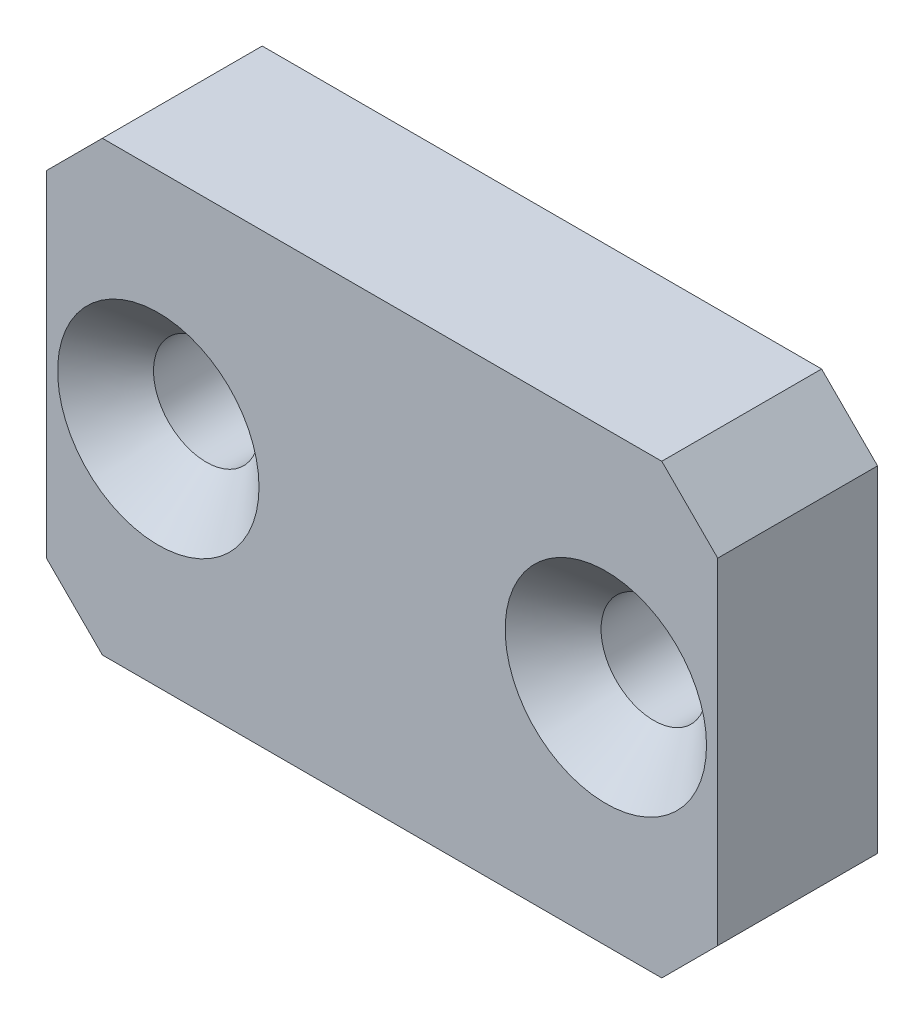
ISO-10303-21;
HEADER;
FILE_DESCRIPTION(('STEP AP214'),'2;1');
FILE_NAME('part.step','',(''),(''),'','','');
FILE_SCHEMA(('AUTOMOTIVE_DESIGN { 1 0 10303 214 1 1 1 1 }'));
ENDSEC;
DATA;
#1=APPLICATION_CONTEXT('core data for automotive mechanical design processes');
#2=APPLICATION_PROTOCOL_DEFINITION('international standard','automotive_design',2000,#1);
#3=PRODUCT_CONTEXT('',#1,'mechanical');
#4=PRODUCT('Part','Part','',(#3));
#5=PRODUCT_RELATED_PRODUCT_CATEGORY('part','',(#4));
#6=PRODUCT_DEFINITION_FORMATION('','',#4);
#7=PRODUCT_DEFINITION_CONTEXT('part definition',#1,'design');
#8=PRODUCT_DEFINITION('design','',#6,#7);
#9=PRODUCT_DEFINITION_SHAPE('','',#8);
#10=(LENGTH_UNIT() NAMED_UNIT(*) SI_UNIT(.MILLI.,.METRE.));
#11=(NAMED_UNIT(*) PLANE_ANGLE_UNIT() SI_UNIT($,.RADIAN.));
#12=(NAMED_UNIT(*) SI_UNIT($,.STERADIAN.) SOLID_ANGLE_UNIT());
#13=UNCERTAINTY_MEASURE_WITH_UNIT(LENGTH_MEASURE(1.E-05),#10,'distance_accuracy_value','');
#14=(GEOMETRIC_REPRESENTATION_CONTEXT(3) GLOBAL_UNCERTAINTY_ASSIGNED_CONTEXT((#13)) GLOBAL_UNIT_ASSIGNED_CONTEXT((#10,
#11,#12)) REPRESENTATION_CONTEXT('',''));
#15=CARTESIAN_POINT('',(0.,0.,0.));
#16=DIRECTION('',(0.,0.,1.));
#17=DIRECTION('',(1.,0.,0.));
#18=AXIS2_PLACEMENT_3D('',#15,#16,#17);
#19=CARTESIAN_POINT('',(-21.,14.,10.));
#20=DIRECTION('',(1.,0.,0.));
#21=DIRECTION('',(0.,0.,-1.));
#22=AXIS2_PLACEMENT_3D('',#19,#20,#21);
#23=PLANE('',#22);
#24=DIRECTION('',(0.,-1.,0.));
#25=VECTOR('',#24,1.);
#26=CARTESIAN_POINT('',(-21.,14.,0.));
#27=LINE('',#26,#25);
#28=CARTESIAN_POINT('',(-21.,10.5,0.));
#29=VERTEX_POINT('',#28);
#30=CARTESIAN_POINT('',(-21.,-10.5,0.));
#31=VERTEX_POINT('',#30);
#32=EDGE_CURVE('E159',#29,#31,#27,.T.);
#33=ORIENTED_EDGE('',*,*,#32,.T.);
#34=DIRECTION('',(0.,0.,1.));
#35=VECTOR('',#34,1.);
#36=CARTESIAN_POINT('',(-21.,-10.5,10.));
#37=LINE('',#36,#35);
#38=CARTESIAN_POINT('',(-21.,-10.5,10.));
#39=VERTEX_POINT('',#38);
#40=EDGE_CURVE('E11',#31,#39,#37,.T.);
#41=ORIENTED_EDGE('',*,*,#40,.T.);
#42=DIRECTION('',(0.,-1.,0.));
#43=VECTOR('',#42,1.);
#44=CARTESIAN_POINT('',(-21.,14.,10.));
#45=LINE('',#44,#43);
#46=CARTESIAN_POINT('',(-21.,10.5,10.));
#47=VERTEX_POINT('',#46);
#48=EDGE_CURVE('E127',#47,#39,#45,.T.);
#49=ORIENTED_EDGE('',*,*,#48,.F.);
#50=DIRECTION('',(0.,0.,-1.));
#51=VECTOR('',#50,1.);
#52=CARTESIAN_POINT('',(-21.,10.5,10.));
#53=LINE('',#52,#51);
#54=EDGE_CURVE('E43',#47,#29,#53,.T.);
#55=ORIENTED_EDGE('',*,*,#54,.T.);
#56=EDGE_LOOP('',(#33,#41,#49,#55));
#57=FACE_BOUND('',#56,.T.);
#58=ADVANCED_FACE('F35',(#57),#23,.F.);
#59=CARTESIAN_POINT('',(-21.,-14.,10.));
#60=DIRECTION('',(0.,1.,0.));
#61=DIRECTION('',(-1.,0.,0.));
#62=AXIS2_PLACEMENT_3D('',#59,#60,#61);
#63=PLANE('',#62);
#64=DIRECTION('',(1.,0.,0.));
#65=VECTOR('',#64,1.);
#66=CARTESIAN_POINT('',(-21.,-14.,0.));
#67=LINE('',#66,#65);
#68=CARTESIAN_POINT('',(-17.5,-14.,0.));
#69=VERTEX_POINT('',#68);
#70=CARTESIAN_POINT('',(17.5,-14.,0.));
#71=VERTEX_POINT('',#70);
#72=EDGE_CURVE('E132',#69,#71,#67,.T.);
#73=ORIENTED_EDGE('',*,*,#72,.T.);
#74=DIRECTION('',(0.,0.,1.));
#75=VECTOR('',#74,1.);
#76=CARTESIAN_POINT('',(17.5,-14.,10.));
#77=LINE('',#76,#75);
#78=CARTESIAN_POINT('',(17.5,-14.,10.));
#79=VERTEX_POINT('',#78);
#80=EDGE_CURVE('E50',#71,#79,#77,.T.);
#81=ORIENTED_EDGE('',*,*,#80,.T.);
#82=DIRECTION('',(1.,0.,0.));
#83=VECTOR('',#82,1.);
#84=CARTESIAN_POINT('',(-21.,-14.,10.));
#85=LINE('',#84,#83);
#86=CARTESIAN_POINT('',(-17.5,-14.,10.));
#87=VERTEX_POINT('',#86);
#88=EDGE_CURVE('E130',#87,#79,#85,.T.);
#89=ORIENTED_EDGE('',*,*,#88,.F.);
#90=DIRECTION('',(0.,0.,-1.));
#91=VECTOR('',#90,1.);
#92=CARTESIAN_POINT('',(-17.5,-14.,10.));
#93=LINE('',#92,#91);
#94=EDGE_CURVE('E151',#87,#69,#93,.T.);
#95=ORIENTED_EDGE('',*,*,#94,.T.);
#96=EDGE_LOOP('',(#73,#81,#89,#95));
#97=FACE_BOUND('',#96,.T.);
#98=ADVANCED_FACE('F217',(#97),#63,.F.);
#99=CARTESIAN_POINT('',(21.,14.,10.));
#100=DIRECTION('',(-1.,0.,0.));
#101=DIRECTION('',(0.,0.,1.));
#102=AXIS2_PLACEMENT_3D('',#99,#100,#101);
#103=PLANE('',#102);
#104=DIRECTION('',(0.,1.,0.));
#105=VECTOR('',#104,1.);
#106=CARTESIAN_POINT('',(21.,14.,0.));
#107=LINE('',#106,#105);
#108=CARTESIAN_POINT('',(21.,-10.5,0.));
#109=VERTEX_POINT('',#108);
#110=CARTESIAN_POINT('',(21.,10.5,0.));
#111=VERTEX_POINT('',#110);
#112=EDGE_CURVE('E128',#109,#111,#107,.T.);
#113=ORIENTED_EDGE('',*,*,#112,.T.);
#114=DIRECTION('',(0.,0.,1.));
#115=VECTOR('',#114,1.);
#116=CARTESIAN_POINT('',(21.,10.5,10.));
#117=LINE('',#116,#115);
#118=CARTESIAN_POINT('',(21.,10.5,10.));
#119=VERTEX_POINT('',#118);
#120=EDGE_CURVE('E106',#111,#119,#117,.T.);
#121=ORIENTED_EDGE('',*,*,#120,.T.);
#122=DIRECTION('',(0.,1.,0.));
#123=VECTOR('',#122,1.);
#124=CARTESIAN_POINT('',(21.,14.,10.));
#125=LINE('',#124,#123);
#126=CARTESIAN_POINT('',(21.,-10.5,10.));
#127=VERTEX_POINT('',#126);
#128=EDGE_CURVE('E171',#127,#119,#125,.T.);
#129=ORIENTED_EDGE('',*,*,#128,.F.);
#130=DIRECTION('',(0.,0.,-1.));
#131=VECTOR('',#130,1.);
#132=CARTESIAN_POINT('',(21.,-10.5,10.));
#133=LINE('',#132,#131);
#134=EDGE_CURVE('E111',#127,#109,#133,.T.);
#135=ORIENTED_EDGE('',*,*,#134,.T.);
#136=EDGE_LOOP('',(#113,#121,#129,#135));
#137=FACE_BOUND('',#136,.T.);
#138=ADVANCED_FACE('F214',(#137),#103,.F.);
#139=CARTESIAN_POINT('',(-21.,14.,10.));
#140=DIRECTION('',(0.,-1.,0.));
#141=DIRECTION('',(1.,0.,0.));
#142=AXIS2_PLACEMENT_3D('',#139,#140,#141);
#143=PLANE('',#142);
#144=DIRECTION('',(-1.,0.,0.));
#145=VECTOR('',#144,1.);
#146=CARTESIAN_POINT('',(-21.,14.,10.));
#147=LINE('',#146,#145);
#148=CARTESIAN_POINT('',(17.5,14.,10.));
#149=VERTEX_POINT('',#148);
#150=CARTESIAN_POINT('',(-17.5,14.,10.));
#151=VERTEX_POINT('',#150);
#152=EDGE_CURVE('E121',#149,#151,#147,.T.);
#153=ORIENTED_EDGE('',*,*,#152,.F.);
#154=DIRECTION('',(0.,0.,-1.));
#155=VECTOR('',#154,1.);
#156=CARTESIAN_POINT('',(17.5,14.,10.));
#157=LINE('',#156,#155);
#158=CARTESIAN_POINT('',(17.5,14.,0.));
#159=VERTEX_POINT('',#158);
#160=EDGE_CURVE('E105',#149,#159,#157,.T.);
#161=ORIENTED_EDGE('',*,*,#160,.T.);
#162=DIRECTION('',(-1.,0.,0.));
#163=VECTOR('',#162,1.);
#164=CARTESIAN_POINT('',(-21.,14.,0.));
#165=LINE('',#164,#163);
#166=CARTESIAN_POINT('',(-17.5,14.,0.));
#167=VERTEX_POINT('',#166);
#168=EDGE_CURVE('E118',#159,#167,#165,.T.);
#169=ORIENTED_EDGE('',*,*,#168,.T.);
#170=DIRECTION('',(0.,0.,1.));
#171=VECTOR('',#170,1.);
#172=CARTESIAN_POINT('',(-17.5,14.,10.));
#173=LINE('',#172,#171);
#174=EDGE_CURVE('E123',#167,#151,#173,.T.);
#175=ORIENTED_EDGE('',*,*,#174,.T.);
#176=EDGE_LOOP('',(#153,#161,#169,#175));
#177=FACE_BOUND('',#176,.T.);
#178=ADVANCED_FACE('F117',(#177),#143,.F.);
#179=CARTESIAN_POINT('',(-21.,-14.,10.));
#180=DIRECTION('',(0.,0.,1.));
#181=DIRECTION('',(1.,0.,0.));
#182=AXIS2_PLACEMENT_3D('',#179,#180,#181);
#183=PLANE('',#182);
#184=CARTESIAN_POINT('',(-14.,0.,10.));
#185=DIRECTION('',(0.,0.,1.));
#186=DIRECTION('',(1.,0.,0.));
#187=AXIS2_PLACEMENT_3D('',#184,#185,#186);
#188=CIRCLE('',#187,6.3);
#189=CARTESIAN_POINT('',(-7.7,0.,10.));
#190=VERTEX_POINT('',#189);
#191=EDGE_CURVE('E180',#190,#190,#188,.T.);
#192=ORIENTED_EDGE('',*,*,#191,.F.);
#193=EDGE_LOOP('',(#192));
#194=FACE_BOUND('',#193,.T.);
#195=CARTESIAN_POINT('',(14.,0.,10.));
#196=DIRECTION('',(0.,0.,1.));
#197=DIRECTION('',(1.,0.,0.));
#198=AXIS2_PLACEMENT_3D('',#195,#196,#197);
#199=CIRCLE('',#198,6.3);
#200=CARTESIAN_POINT('',(20.3,0.,10.));
#201=VERTEX_POINT('',#200);
#202=EDGE_CURVE('E164',#201,#201,#199,.T.);
#203=ORIENTED_EDGE('',*,*,#202,.F.);
#204=EDGE_LOOP('',(#203));
#205=FACE_BOUND('',#204,.T.);
#206=ORIENTED_EDGE('',*,*,#128,.T.);
#207=DIRECTION('',(0.707106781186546,-0.707106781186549,0.));
#208=VECTOR('',#207,1.);
#209=CARTESIAN_POINT('',(12.2500000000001,19.2499999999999,10.));
#210=LINE('',#209,#208);
#211=EDGE_CURVE('E149',#119,#149,#210,.F.);
#212=ORIENTED_EDGE('',*,*,#211,.T.);
#213=ORIENTED_EDGE('',*,*,#152,.T.);
#214=DIRECTION('',(0.707106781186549,0.707106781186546,0.));
#215=VECTOR('',#214,1.);
#216=CARTESIAN_POINT('',(-33.25,-1.74999999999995,10.));
#217=LINE('',#216,#215);
#218=EDGE_CURVE('E144',#151,#47,#217,.F.);
#219=ORIENTED_EDGE('',*,*,#218,.T.);
#220=ORIENTED_EDGE('',*,*,#48,.T.);
#221=DIRECTION('',(-0.707106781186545,0.70710678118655,0.));
#222=VECTOR('',#221,1.);
#223=CARTESIAN_POINT('',(-19.25,-12.25,10.));
#224=LINE('',#223,#222);
#225=EDGE_CURVE('E57',#39,#87,#224,.F.);
#226=ORIENTED_EDGE('',*,*,#225,.T.);
#227=ORIENTED_EDGE('',*,*,#88,.T.);
#228=DIRECTION('',(-0.707106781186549,-0.707106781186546,0.));
#229=VECTOR('',#228,1.);
#230=CARTESIAN_POINT('',(-1.75000000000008,-33.25,10.));
#231=LINE('',#230,#229);
#232=EDGE_CURVE('E147',#79,#127,#231,.F.);
#233=ORIENTED_EDGE('',*,*,#232,.T.);
#234=EDGE_LOOP('',(#206,#212,#213,#219,#220,#226,#227,#233));
#235=FACE_BOUND('',#234,.T.);
#236=ADVANCED_FACE('F205',(#194,#205,#235),#183,.T.);
#237=CARTESIAN_POINT('',(-21.,-14.,0.));
#238=DIRECTION('',(0.,0.,1.));
#239=DIRECTION('',(1.,0.,0.));
#240=AXIS2_PLACEMENT_3D('',#237,#238,#239);
#241=PLANE('',#240);
#242=CARTESIAN_POINT('',(-14.,0.,0.));
#243=DIRECTION('',(0.,0.,1.));
#244=DIRECTION('',(1.,0.,0.));
#245=AXIS2_PLACEMENT_3D('',#242,#243,#244);
#246=CIRCLE('',#245,3.3);
#247=CARTESIAN_POINT('',(-10.7,0.,0.));
#248=VERTEX_POINT('',#247);
#249=EDGE_CURVE('E186',#248,#248,#246,.T.);
#250=ORIENTED_EDGE('',*,*,#249,.T.);
#251=EDGE_LOOP('',(#250));
#252=FACE_BOUND('',#251,.T.);
#253=CARTESIAN_POINT('',(14.,0.,0.));
#254=DIRECTION('',(0.,0.,1.));
#255=DIRECTION('',(1.,0.,0.));
#256=AXIS2_PLACEMENT_3D('',#253,#254,#255);
#257=CIRCLE('',#256,3.3);
#258=CARTESIAN_POINT('',(17.3,0.,0.));
#259=VERTEX_POINT('',#258);
#260=EDGE_CURVE('E177',#259,#259,#257,.T.);
#261=ORIENTED_EDGE('',*,*,#260,.T.);
#262=EDGE_LOOP('',(#261));
#263=FACE_BOUND('',#262,.T.);
#264=ORIENTED_EDGE('',*,*,#168,.F.);
#265=DIRECTION('',(-0.707106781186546,0.707106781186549,0.));
#266=VECTOR('',#265,1.);
#267=CARTESIAN_POINT('',(17.5,14.,0.));
#268=LINE('',#267,#266);
#269=EDGE_CURVE('E101',#159,#111,#268,.F.);
#270=ORIENTED_EDGE('',*,*,#269,.T.);
#271=ORIENTED_EDGE('',*,*,#112,.F.);
#272=DIRECTION('',(0.707106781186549,0.707106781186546,0.));
#273=VECTOR('',#272,1.);
#274=CARTESIAN_POINT('',(21.,-10.5,0.));
#275=LINE('',#274,#273);
#276=EDGE_CURVE('E112',#109,#71,#275,.F.);
#277=ORIENTED_EDGE('',*,*,#276,.T.);
#278=ORIENTED_EDGE('',*,*,#72,.F.);
#279=DIRECTION('',(0.707106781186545,-0.70710678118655,0.));
#280=VECTOR('',#279,1.);
#281=CARTESIAN_POINT('',(-17.5,-14.,0.));
#282=LINE('',#281,#280);
#283=EDGE_CURVE('E138',#69,#31,#282,.F.);
#284=ORIENTED_EDGE('',*,*,#283,.T.);
#285=ORIENTED_EDGE('',*,*,#32,.F.);
#286=DIRECTION('',(-0.707106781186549,-0.707106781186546,0.));
#287=VECTOR('',#286,1.);
#288=CARTESIAN_POINT('',(-21.,10.5,0.));
#289=LINE('',#288,#287);
#290=EDGE_CURVE('E122',#29,#167,#289,.F.);
#291=ORIENTED_EDGE('',*,*,#290,.T.);
#292=EDGE_LOOP('',(#264,#270,#271,#277,#278,#284,#285,#291));
#293=FACE_BOUND('',#292,.T.);
#294=ADVANCED_FACE('F125',(#252,#263,#293),#241,.F.);
#295=CARTESIAN_POINT('',(14.,0.,10.));
#296=DIRECTION('',(0.,0.,1.));
#297=DIRECTION('',(1.,0.,0.));
#298=AXIS2_PLACEMENT_3D('',#295,#296,#297);
#299=CONICAL_SURFACE('',#298,6.3,0.785398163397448);
#300=CARTESIAN_POINT('',(14.,0.,7.));
#301=DIRECTION('',(0.,0.,1.));
#302=DIRECTION('',(1.,0.,0.));
#303=AXIS2_PLACEMENT_3D('',#300,#301,#302);
#304=CIRCLE('',#303,3.3);
#305=CARTESIAN_POINT('',(17.3,0.,7.));
#306=VERTEX_POINT('',#305);
#307=EDGE_CURVE('E167',#306,#306,#304,.T.);
#308=ORIENTED_EDGE('',*,*,#307,.F.);
#309=EDGE_LOOP('',(#308));
#310=FACE_BOUND('',#309,.T.);
#311=ORIENTED_EDGE('',*,*,#202,.T.);
#312=EDGE_LOOP('',(#311));
#313=FACE_BOUND('',#312,.T.);
#314=ADVANCED_FACE('F275',(#310,#313),#299,.F.);
#315=CARTESIAN_POINT('',(14.,0.,10.));
#316=DIRECTION('',(0.,0.,1.));
#317=DIRECTION('',(1.,0.,0.));
#318=AXIS2_PLACEMENT_3D('',#315,#316,#317);
#319=CYLINDRICAL_SURFACE('',#318,3.3);
#320=ORIENTED_EDGE('',*,*,#260,.F.);
#321=EDGE_LOOP('',(#320));
#322=FACE_BOUND('',#321,.T.);
#323=ORIENTED_EDGE('',*,*,#307,.T.);
#324=EDGE_LOOP('',(#323));
#325=FACE_BOUND('',#324,.T.);
#326=ADVANCED_FACE('F201',(#322,#325),#319,.F.);
#327=CARTESIAN_POINT('',(-14.,0.,10.));
#328=DIRECTION('',(0.,0.,1.));
#329=DIRECTION('',(1.,0.,0.));
#330=AXIS2_PLACEMENT_3D('',#327,#328,#329);
#331=CONICAL_SURFACE('',#330,6.3,0.785398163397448);
#332=CARTESIAN_POINT('',(-14.,0.,7.));
#333=DIRECTION('',(0.,0.,1.));
#334=DIRECTION('',(1.,0.,0.));
#335=AXIS2_PLACEMENT_3D('',#332,#333,#334);
#336=CIRCLE('',#335,3.3);
#337=CARTESIAN_POINT('',(-10.7,0.,7.));
#338=VERTEX_POINT('',#337);
#339=EDGE_CURVE('E183',#338,#338,#336,.T.);
#340=ORIENTED_EDGE('',*,*,#339,.F.);
#341=EDGE_LOOP('',(#340));
#342=FACE_BOUND('',#341,.T.);
#343=ORIENTED_EDGE('',*,*,#191,.T.);
#344=EDGE_LOOP('',(#343));
#345=FACE_BOUND('',#344,.T.);
#346=ADVANCED_FACE('F195',(#342,#345),#331,.F.);
#347=CARTESIAN_POINT('',(-14.,0.,10.));
#348=DIRECTION('',(0.,0.,1.));
#349=DIRECTION('',(1.,0.,0.));
#350=AXIS2_PLACEMENT_3D('',#347,#348,#349);
#351=CYLINDRICAL_SURFACE('',#350,3.3);
#352=ORIENTED_EDGE('',*,*,#249,.F.);
#353=EDGE_LOOP('',(#352));
#354=FACE_BOUND('',#353,.T.);
#355=ORIENTED_EDGE('',*,*,#339,.T.);
#356=EDGE_LOOP('',(#355));
#357=FACE_BOUND('',#356,.T.);
#358=ADVANCED_FACE('F192',(#354,#357),#351,.F.);
#359=CARTESIAN_POINT('',(17.5,14.,10.));
#360=DIRECTION('',(-0.707106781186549,-0.707106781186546,0.));
#361=DIRECTION('',(0.707106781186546,-0.707106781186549,0.));
#362=AXIS2_PLACEMENT_3D('',#359,#360,#361);
#363=PLANE('',#362);
#364=ORIENTED_EDGE('',*,*,#211,.F.);
#365=ORIENTED_EDGE('',*,*,#120,.F.);
#366=ORIENTED_EDGE('',*,*,#269,.F.);
#367=ORIENTED_EDGE('',*,*,#160,.F.);
#368=EDGE_LOOP('',(#364,#365,#366,#367));
#369=FACE_BOUND('',#368,.T.);
#370=ADVANCED_FACE('F104',(#369),#363,.F.);
#371=CARTESIAN_POINT('',(21.,-10.5,10.));
#372=DIRECTION('',(-0.707106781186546,0.707106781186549,0.));
#373=DIRECTION('',(-0.707106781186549,-0.707106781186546,0.));
#374=AXIS2_PLACEMENT_3D('',#371,#372,#373);
#375=PLANE('',#374);
#376=ORIENTED_EDGE('',*,*,#232,.F.);
#377=ORIENTED_EDGE('',*,*,#80,.F.);
#378=ORIENTED_EDGE('',*,*,#276,.F.);
#379=ORIENTED_EDGE('',*,*,#134,.F.);
#380=EDGE_LOOP('',(#376,#377,#378,#379));
#381=FACE_BOUND('',#380,.T.);
#382=ADVANCED_FACE('F216',(#381),#375,.F.);
#383=CARTESIAN_POINT('',(-17.5,-14.,10.));
#384=DIRECTION('',(0.70710678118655,0.707106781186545,0.));
#385=DIRECTION('',(-0.707106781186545,0.70710678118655,0.));
#386=AXIS2_PLACEMENT_3D('',#383,#384,#385);
#387=PLANE('',#386);
#388=ORIENTED_EDGE('',*,*,#225,.F.);
#389=ORIENTED_EDGE('',*,*,#40,.F.);
#390=ORIENTED_EDGE('',*,*,#283,.F.);
#391=ORIENTED_EDGE('',*,*,#94,.F.);
#392=EDGE_LOOP('',(#388,#389,#390,#391));
#393=FACE_BOUND('',#392,.T.);
#394=ADVANCED_FACE('F220',(#393),#387,.F.);
#395=CARTESIAN_POINT('',(-21.,10.5,10.));
#396=DIRECTION('',(0.707106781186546,-0.707106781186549,0.));
#397=DIRECTION('',(0.707106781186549,0.707106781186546,0.));
#398=AXIS2_PLACEMENT_3D('',#395,#396,#397);
#399=PLANE('',#398);
#400=ORIENTED_EDGE('',*,*,#218,.F.);
#401=ORIENTED_EDGE('',*,*,#174,.F.);
#402=ORIENTED_EDGE('',*,*,#290,.F.);
#403=ORIENTED_EDGE('',*,*,#54,.F.);
#404=EDGE_LOOP('',(#400,#401,#402,#403));
#405=FACE_BOUND('',#404,.T.);
#406=ADVANCED_FACE('F37',(#405),#399,.F.);
#407=CLOSED_SHELL('',(#58,#98,#138,#178,#236,#294,#314,#326,#346,#358,#370,#382,#394,#406));
#408=MANIFOLD_SOLID_BREP('B2',#407);
#409=ADVANCED_BREP_SHAPE_REPRESENTATION('',(#18,#408),#14);
#410=SHAPE_DEFINITION_REPRESENTATION(#9,#409);
ENDSEC;
END-ISO-10303-21;
